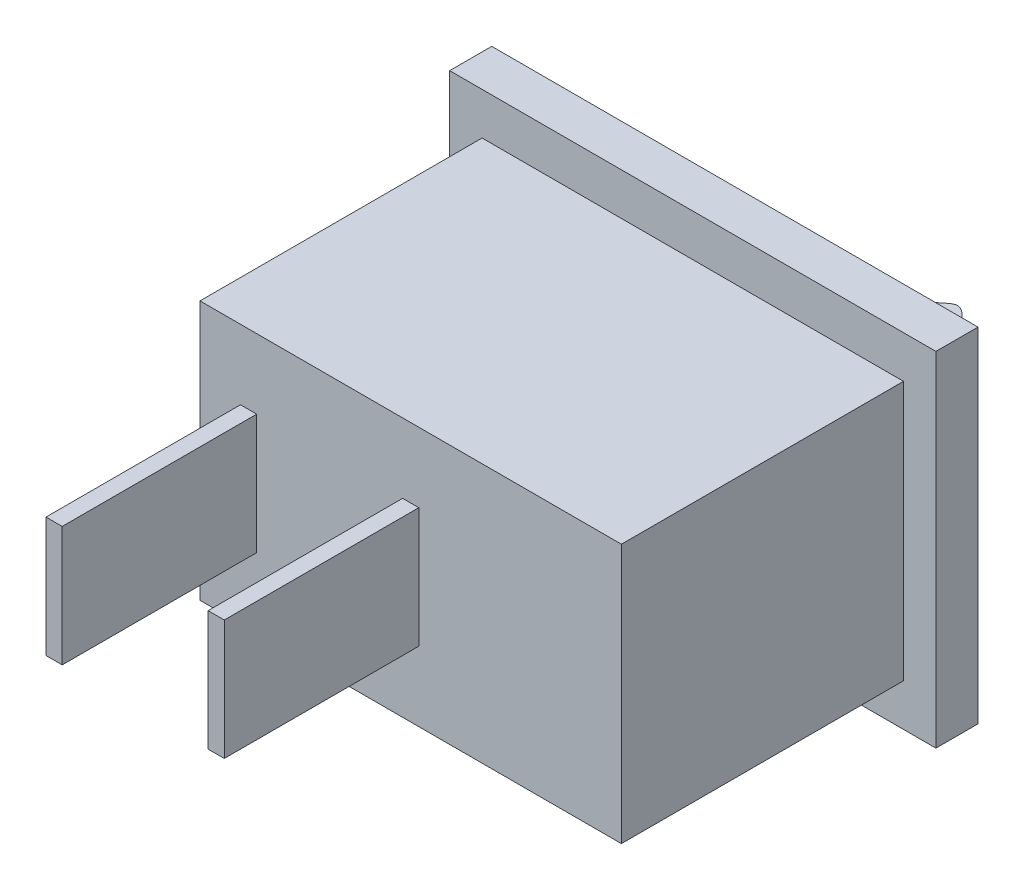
from build123d import *

# Parameters (mm, degrees)
EXTRUDE_1_DEPTH     = 5.3
CUT_EXTRUDE_1_DEPTH = 10.6
SKETCH_3_W          = 13.403879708
SKETCH_3_H          = 2.017233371
SKETCH_3_H_2        = 3.359723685
CUT_EXTRUDE_2_DEPTH = 20.6
SKETCH_4_W          = 5.574503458
SKETCH_4_H          = 13.403879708
SKETCH_4_W_2        = 5.436980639
CUT_EXTRUDE_3_DEPTH = 20.6
EXTRUDE_2_DEPTH     = 2.5


with BuildPart() as part:
    # Sketch 1 → Extrude 1 (new, symmetric)
    with BuildSketch(Plane(origin=(0, 0, 0), x_dir=(1, 0, 0), z_dir=(0, 1, 0))):
        Polygon((-7.5, 8), (7.5, 8), (7.5, -2), (0.25, -2), (0.25, -8), (-0.25, -8), (-0.25, -2), (-4.75, -2), (-4.75, -8), (-5.25, -8), (-5.25, -2), (-7.5, -2), align=None)
    extrude(amount=EXTRUDE_1_DEPTH, both=True)

    # Sketch 2 → Cut-Extrude 1 (cut)
    with BuildSketch(Plane.ZY.offset(7.5)):
        Polygon((2, 1.85), (8, 1.85), (11.665879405, 1.85), (11.665879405, 5.974930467), (2, 5.974930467), align=None)
        Polygon((2, -1.85), (8, -1.85), (11.665879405, -1.85), (11.665879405, -6.080494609), (2, -6.080494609), align=None)
    extrude(amount=-CUT_EXTRUDE_1_DEPTH, mode=Mode.SUBTRACT)

    # Sketch 3 → Cut-Extrude 2 (cut)
    with BuildSketch(Plane.ZY.offset(7.5)):
        with Locations((0, 5.008616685)):
            Rectangle(SKETCH_3_W, SKETCH_3_H)
        with Locations((0, -5.679861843)):
            Rectangle(SKETCH_3_W, SKETCH_3_H_2)
    extrude(amount=-CUT_EXTRUDE_2_DEPTH, mode=Mode.SUBTRACT)

    # Sketch 4 → Cut-Extrude 3 (cut)
    with BuildSketch(Plane.XZ.offset(4)):
        with Locations((-9.287251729, 0)):
            Rectangle(SKETCH_4_W, SKETCH_4_H)
        with Locations((9.21849032, 0)):
            Rectangle(SKETCH_4_W_2, SKETCH_4_H)
    extrude(amount=-CUT_EXTRUDE_3_DEPTH, mode=Mode.SUBTRACT)

    # Sketch 5 → Extrude 2 (add, symmetric)
    with BuildSketch(Plane(origin=(0, 0, 0), x_dir=(1, 0, 0), z_dir=(0, 1, 0))):
        with BuildLine():
            Line((-4.430696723, 8), (5.02015952, 8))
            add(Edge.make_bspline(
                [(3.51678433, 10.901493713), (3.660823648, 11.022840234), (3.921771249, 11.163629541), (4.992983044, 9.890749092), (4.936215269, 8.930533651), (5.02015952, 8)],
                knots=[0, 0, 0, 0, 0.090528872, 0.311978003, 1, 1, 1, 1], degree=3))
            ThreePointArc((3.51678433, 10.901493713), (-0.200415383, 8.748055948), (-4.430696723, 8))
        make_face()
    extrude(amount=EXTRUDE_2_DEPTH, both=True)


solid = part.part
